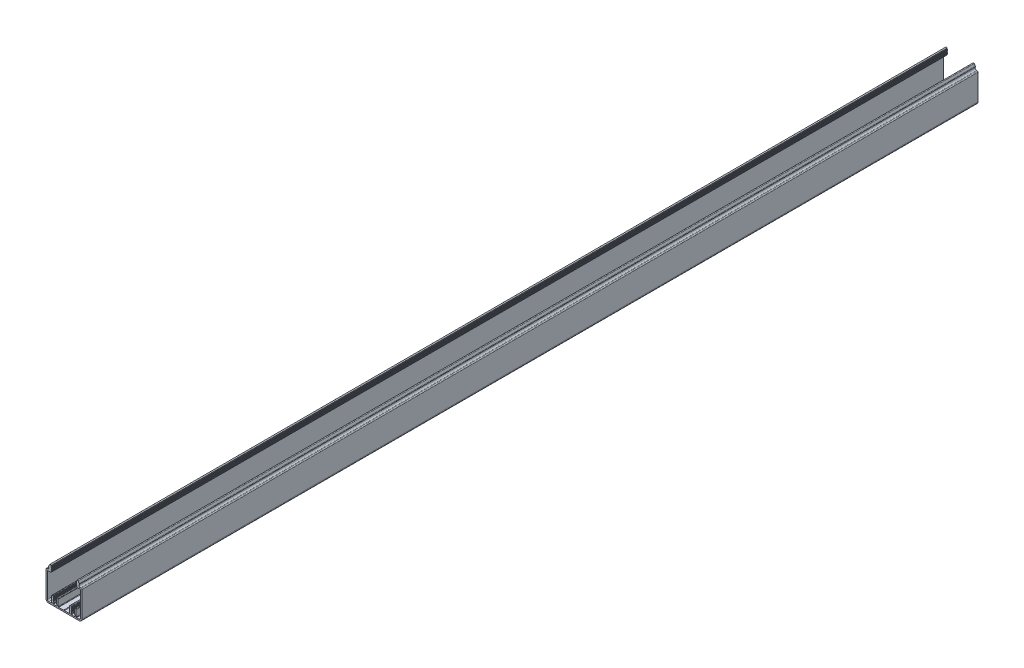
from build123d import *

# Parameters (mm, degrees)
AUFSATZ_LINEAR_AUSTRAGEN1_DEPTH = 1000


with BuildPart() as part:
    # Model → Aufsatz-Linear austragen1 (new body)
    with BuildSketch(Plane.XY):
        with BuildLine():
            Line((153.665766, -4.282069), (153.665776, -3.787725))
            ThreePointArc((153.665776, -3.787725), (154.223039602, -3.061508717), (155.068745, -3.411816))
            Line((155.068745, -3.411816), (156.225156, -5.414778))
            ThreePointArc((156.225156, -5.414778), (156.358888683, -5.93682507), (156.202274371, -6.452469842))
            ThreePointArc((156.202274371, -6.452469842), (156.150046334, -8.031106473), (157.509144, -8.835889))
            Line((157.509144, -8.835889), (158.159126, -8.835888))
            ThreePointArc((158.159126, -8.835888), (158.866233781, -9.128781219), (159.159127, -9.835889))
            Line((159.159127, -9.835889), (159.159097, -38.335891))
            ThreePointArc((159.159097, -38.335891), (158.280420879, -40.457207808), (156.159107, -41.335891))
            Line((156.159107, -41.335891), (122.159118, -41.335891))
            ThreePointArc((122.159118, -41.335891), (120.037797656, -40.457211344), (119.159118, -38.335891))
            Line((119.159118, -38.335891), (119.159117, -9.835888))
            ThreePointArc((119.159117, -9.835888), (119.452010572, -9.128779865), (120.159119, -8.835887))
            Line((120.159119, -8.835887), (120.809101, -8.835888))
            ThreePointArc((120.809101, -8.835888), (122.168199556, -8.031105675), (122.115971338, -6.452468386))
            ThreePointArc((122.115971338, -6.452468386), (121.959356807, -5.93682394), (122.093089, -5.414777))
            Line((122.093089, -5.414777), (123.249498, -3.411817))
            ThreePointArc((123.249498, -3.411817), (124.095204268, -3.06150795), (124.652468, -3.787726))
            Line((124.652468, -3.787726), (124.652477, -4.282063))
            Line((124.652477, -4.282063), (125.209128, -4.603445))
            Line((125.209128, -4.603445), (125.209128, -5.368359))
            Line((125.209128, -5.368359), (124.659128, -5.685902))
            Line((124.659128, -5.685902), (125.209128, -6.003444))
            Line((125.209128, -6.003444), (125.209128, -6.768351))
            Line((125.209128, -6.768351), (124.659128, -7.085891))
            Line((124.659128, -7.085891), (125.209128, -7.403434))
            Line((125.209128, -7.403434), (125.209128, -8.168348))
            Line((125.209128, -8.168348), (124.659128, -8.485891))
            Line((124.659128, -8.485891), (125.209128, -8.803434))
            Line((125.209128, -8.803434), (125.209128, -9.568348))
            Line((125.209128, -9.568348), (124.658192, -9.88643))
            Line((124.658192, -9.88643), (124.658041, -10.335891))
            Line((124.658041, -10.335891), (121.159118, -10.33589))
            ThreePointArc((121.159118, -10.33589), (120.805564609, -10.482336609), (120.659118, -10.83589))
            Line((120.659118, -10.83589), (120.659118, -38.335891))
            ThreePointArc((120.659118, -38.335891), (121.098461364, -39.396554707), (122.159128, -39.835891))
            Line((122.159128, -39.835891), (125.009126, -39.83589))
            ThreePointArc((125.009126, -39.83589), (125.362679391, -39.689443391), (125.509126, -39.33589))
            Line((125.509126, -39.33589), (125.509126, -32.335899))
            ThreePointArc((125.509126, -32.335899), (125.655572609, -31.982345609), (126.009126, -31.835899))
            Line((126.009126, -31.835899), (127.009126, -31.835899))
            Line((127.009126, -31.835899), (127.009126, -32.185899))
            Line((127.009126, -32.185899), (127.559126, -32.503442))
            Line((127.559126, -32.503442), (127.559126, -33.268356))
            Line((127.559126, -33.268356), (127.009126, -33.585899))
            Line((127.009126, -33.585899), (127.559126, -33.903442))
            Line((127.559126, -33.903442), (127.559126, -34.668356))
            Line((127.559126, -34.668356), (127.009126, -34.985899))
            Line((127.009126, -34.985899), (127.559126, -35.30344))
            Line((127.559126, -35.30344), (127.559126, -36.068347))
            Line((127.559126, -36.068347), (127.009126, -36.38589))
            Line((127.009126, -36.38589), (127.559126, -36.703433))
            Line((127.559126, -36.703433), (127.559126, -37.468347))
            Line((127.559126, -37.468347), (127.009126, -37.78589))
            Line((127.009126, -37.78589), (127.009126, -39.33589))
            ThreePointArc((127.009126, -39.33589), (127.155572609, -39.689443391), (127.509126, -39.83589))
            Line((127.509126, -39.83589), (130.809116, -39.83589))
            ThreePointArc((130.809116, -39.83589), (131.162669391, -39.689443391), (131.309116, -39.33589))
            Line((131.309116, -39.33589), (131.309116, -38.48589))
            Line((131.309116, -38.48589), (130.759116, -38.168347))
            Line((130.759116, -38.168347), (130.759116, -37.403433))
            Line((130.759116, -37.403433), (131.309116, -37.08589))
            Line((131.309116, -37.08589), (130.759116, -36.768347))
            Line((130.759116, -36.768347), (130.759116, -36.003433))
            Line((130.759116, -36.003433), (131.309116, -35.68589))
            Line((131.309116, -35.68589), (130.759116, -35.368347))
            Line((130.759116, -35.368347), (130.759116, -34.603442))
            Line((130.759116, -34.603442), (131.309116, -34.285899))
            Line((131.309116, -34.285899), (130.759116, -33.968356))
            Line((130.759116, -33.968356), (130.759116, -33.203442))
            Line((130.759116, -33.203442), (131.309116, -32.885899))
            Line((131.309116, -32.885899), (130.759116, -32.568356))
            Line((130.759116, -32.568356), (130.759116, -32.335899))
            ThreePointArc((130.759116, -32.335899), (130.905562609, -31.982345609), (131.259116, -31.835899))
            Line((131.259116, -31.835899), (132.309116, -31.835899))
            ThreePointArc((132.309116, -31.835899), (132.662669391, -31.982345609), (132.809116, -32.335899))
            Line((132.809116, -32.335899), (132.809116, -39.33589))
            ThreePointArc((132.809116, -39.33589), (132.955562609, -39.689443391), (133.309116, -39.83589))
            Line((133.309116, -39.83589), (138.812707, -39.83589))
            ThreePointArc((138.812707, -39.83589), (139.159118, -39.53588419), (139.505529, -39.83589))
            Line((139.505529, -39.83589), (145.009121, -39.83589))
            ThreePointArc((145.009121, -39.83589), (145.362673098, -39.689442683), (145.509119, -39.33589))
            Line((145.509119, -39.33589), (145.509119, -32.335899))
            ThreePointArc((145.509119, -32.335899), (145.655565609, -31.982345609), (146.009119, -31.835899))
            Line((146.009119, -31.835899), (147.059119, -31.835899))
            ThreePointArc((147.059119, -31.835899), (147.412672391, -31.982345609), (147.559119, -32.335899))
            Line((147.559119, -32.335899), (147.559119, -32.568356))
            Line((147.559119, -32.568356), (147.009119, -32.885899))
            Line((147.009119, -32.885899), (147.559119, -33.203442))
            Line((147.559119, -33.203442), (147.559119, -33.968356))
            Line((147.559119, -33.968356), (147.009119, -34.285899))
            Line((147.009119, -34.285899), (147.559119, -34.603442))
            Line((147.559119, -34.603442), (147.559119, -35.368347))
            Line((147.559119, -35.368347), (147.009119, -35.68589))
            Line((147.009119, -35.68589), (147.559119, -36.003433))
            Line((147.559119, -36.003433), (147.559119, -36.768347))
            Line((147.559119, -36.768347), (147.009119, -37.08589))
            Line((147.009119, -37.08589), (147.559119, -37.403433))
            Line((147.559119, -37.403433), (147.559119, -38.168347))
            Line((147.559119, -38.168347), (147.009119, -38.48589))
            Line((147.009119, -38.48589), (147.009119, -39.33589))
            ThreePointArc((147.009119, -39.33589), (147.155565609, -39.689443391), (147.509119, -39.83589))
            Line((147.509119, -39.83589), (150.809109, -39.83589))
            ThreePointArc((150.809109, -39.83589), (151.162662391, -39.689443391), (151.309109, -39.33589))
            Line((151.309109, -39.33589), (151.309109, -37.78589))
            Line((151.309109, -37.78589), (150.759109, -37.468347))
            Line((150.759109, -37.468347), (150.759109, -36.703433))
            Line((150.759109, -36.703433), (151.309109, -36.38589))
            Line((151.309109, -36.38589), (150.759109, -36.068347))
            Line((150.759109, -36.068347), (150.759109, -35.30344))
            Line((150.759109, -35.30344), (151.309109, -34.985899))
            Line((151.309109, -34.985899), (150.759109, -34.668356))
            Line((150.759109, -34.668356), (150.759109, -33.903442))
            Line((150.759109, -33.903442), (151.309109, -33.585899))
            Line((151.309109, -33.585899), (150.759109, -33.268356))
            Line((150.759109, -33.268356), (150.759109, -32.503442))
            Line((150.759109, -32.503442), (151.309109, -32.185899))
            Line((151.309109, -32.185899), (151.309109, -31.835899))
            Line((151.309109, -31.835899), (152.309109, -31.835899))
            ThreePointArc((152.309109, -31.835899), (152.662662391, -31.982345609), (152.809109, -32.335899))
            Line((152.809109, -32.335899), (152.809109, -39.33589))
            ThreePointArc((152.809109, -39.33589), (152.95555667, -39.689444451), (153.309112, -39.83589))
            Line((153.309112, -39.83589), (156.159109, -39.835891))
            ThreePointArc((156.159109, -39.835891), (157.219761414, -39.396546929), (157.659097, -38.335891))
            Line((157.659097, -38.335891), (157.659127, -10.835891))
            ThreePointArc((157.659127, -10.835891), (157.512680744, -10.482336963), (157.159127, -10.33589))
            Line((157.159127, -10.33589), (153.6602, -10.335891))
            Line((153.6602, -10.335891), (153.660049, -9.886438))
            Line((153.660049, -9.886438), (153.109113, -9.568356))
            Line((153.109113, -9.568356), (153.109113, -8.803442))
            Line((153.109113, -8.803442), (153.659113, -8.485899))
            Line((153.659113, -8.485899), (153.109113, -8.168356))
            Line((153.109113, -8.168356), (153.109113, -7.403442))
            Line((153.109113, -7.403442), (153.659113, -7.085899))
            Line((153.659113, -7.085899), (153.109113, -6.768359))
            Line((153.109113, -6.768359), (153.109113, -6.003452))
            Line((153.109113, -6.003452), (153.659113, -5.68591))
            Line((153.659113, -5.68591), (153.109113, -5.368367))
            Line((153.109113, -5.368367), (153.109113, -4.603453))
            Line((153.109113, -4.603453), (153.665766, -4.282069))
        make_face()
    extrude(amount=AUFSATZ_LINEAR_AUSTRAGEN1_DEPTH)


solid = part.part
